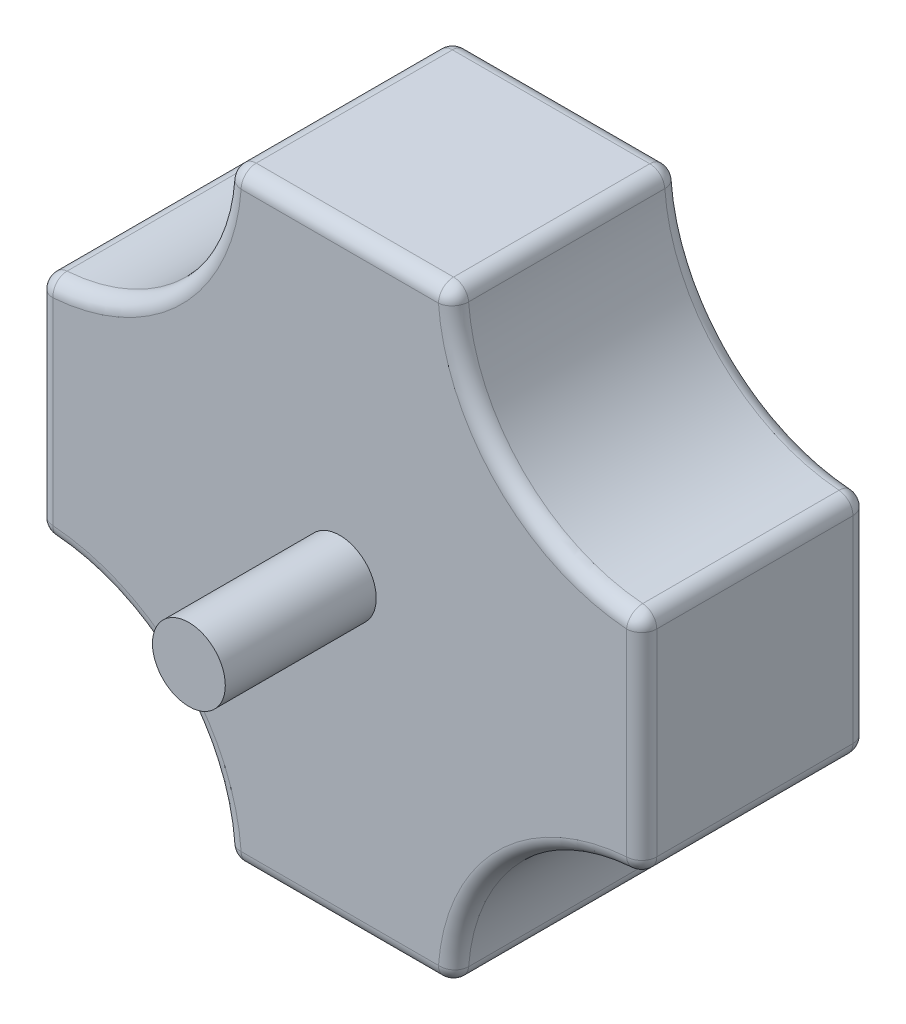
ISO-10303-21;
HEADER;
FILE_DESCRIPTION(('STEP AP214'),'2;1');
FILE_NAME('part.step','',(''),(''),'','','');
FILE_SCHEMA(('AUTOMOTIVE_DESIGN { 1 0 10303 214 1 1 1 1 }'));
ENDSEC;
DATA;
#1=APPLICATION_CONTEXT('core data for automotive mechanical design processes');
#2=APPLICATION_PROTOCOL_DEFINITION('international standard','automotive_design',2000,#1);
#3=PRODUCT_CONTEXT('',#1,'mechanical');
#4=PRODUCT('Part','Part','',(#3));
#5=PRODUCT_RELATED_PRODUCT_CATEGORY('part','',(#4));
#6=PRODUCT_DEFINITION_FORMATION('','',#4);
#7=PRODUCT_DEFINITION_CONTEXT('part definition',#1,'design');
#8=PRODUCT_DEFINITION('design','',#6,#7);
#9=PRODUCT_DEFINITION_SHAPE('','',#8);
#10=(LENGTH_UNIT() NAMED_UNIT(*) SI_UNIT(.MILLI.,.METRE.));
#11=(NAMED_UNIT(*) PLANE_ANGLE_UNIT() SI_UNIT($,.RADIAN.));
#12=(NAMED_UNIT(*) SI_UNIT($,.STERADIAN.) SOLID_ANGLE_UNIT());
#13=UNCERTAINTY_MEASURE_WITH_UNIT(LENGTH_MEASURE(1.E-05),#10,'distance_accuracy_value','');
#14=(GEOMETRIC_REPRESENTATION_CONTEXT(3) GLOBAL_UNCERTAINTY_ASSIGNED_CONTEXT((#13)) GLOBAL_UNIT_ASSIGNED_CONTEXT((#10,
#11,#12)) REPRESENTATION_CONTEXT('',''));
#15=CARTESIAN_POINT('',(0.,0.,0.));
#16=DIRECTION('',(0.,0.,1.));
#17=DIRECTION('',(1.,0.,0.));
#18=AXIS2_PLACEMENT_3D('',#15,#16,#17);
#19=CARTESIAN_POINT('',(20.,20.,15.));
#20=DIRECTION('',(0.,0.,-1.));
#21=DIRECTION('',(-1.,0.,0.));
#22=AXIS2_PLACEMENT_3D('',#19,#20,#21);
#23=PLANE('',#22);
#24=DIRECTION('',(1.,0.,0.));
#25=VECTOR('',#24,1.);
#26=CARTESIAN_POINT('',(20.,-19.,15.));
#27=LINE('',#26,#25);
#28=CARTESIAN_POINT('',(-6.53708798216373,-19.,15.));
#29=VERTEX_POINT('',#28);
#30=CARTESIAN_POINT('',(6.53708798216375,-19.,15.));
#31=VERTEX_POINT('',#30);
#32=EDGE_CURVE('E48',#29,#31,#27,.T.);
#33=ORIENTED_EDGE('',*,*,#32,.T.);
#34=CARTESIAN_POINT('',(20.,-20.,15.));
#35=DIRECTION('',(0.,0.,-1.));
#36=DIRECTION('',(-1.,0.,0.));
#37=AXIS2_PLACEMENT_3D('',#34,#35,#36);
#38=CIRCLE('',#37,13.5);
#39=CARTESIAN_POINT('',(19.,-6.53708798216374,15.));
#40=VERTEX_POINT('',#39);
#41=EDGE_CURVE('E41',#31,#40,#38,.T.);
#42=ORIENTED_EDGE('',*,*,#41,.T.);
#43=DIRECTION('',(0.,1.,0.));
#44=VECTOR('',#43,1.);
#45=CARTESIAN_POINT('',(19.,20.,15.));
#46=LINE('',#45,#44);
#47=CARTESIAN_POINT('',(19.,6.53708798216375,15.));
#48=VERTEX_POINT('',#47);
#49=EDGE_CURVE('E312',#40,#48,#46,.T.);
#50=ORIENTED_EDGE('',*,*,#49,.T.);
#51=CARTESIAN_POINT('',(20.,20.,15.));
#52=DIRECTION('',(0.,0.,-1.));
#53=DIRECTION('',(-1.,0.,0.));
#54=AXIS2_PLACEMENT_3D('',#51,#52,#53);
#55=CIRCLE('',#54,13.5);
#56=CARTESIAN_POINT('',(6.53708798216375,19.,15.));
#57=VERTEX_POINT('',#56);
#58=EDGE_CURVE('E314',#48,#57,#55,.T.);
#59=ORIENTED_EDGE('',*,*,#58,.T.);
#60=DIRECTION('',(-1.,0.,0.));
#61=VECTOR('',#60,1.);
#62=CARTESIAN_POINT('',(20.,19.,15.));
#63=LINE('',#62,#61);
#64=CARTESIAN_POINT('',(-6.53708798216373,19.,15.));
#65=VERTEX_POINT('',#64);
#66=EDGE_CURVE('E316',#57,#65,#63,.T.);
#67=ORIENTED_EDGE('',*,*,#66,.T.);
#68=CARTESIAN_POINT('',(-20.,20.,15.));
#69=DIRECTION('',(0.,0.,-1.));
#70=DIRECTION('',(-1.,0.,0.));
#71=AXIS2_PLACEMENT_3D('',#68,#69,#70);
#72=CIRCLE('',#71,13.5);
#73=CARTESIAN_POINT('',(-19.,6.53708798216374,15.));
#74=VERTEX_POINT('',#73);
#75=EDGE_CURVE('E318',#65,#74,#72,.T.);
#76=ORIENTED_EDGE('',*,*,#75,.T.);
#77=DIRECTION('',(0.,-1.,0.));
#78=VECTOR('',#77,1.);
#79=CARTESIAN_POINT('',(-19.,20.,15.));
#80=LINE('',#79,#78);
#81=CARTESIAN_POINT('',(-19.,-6.53708798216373,15.));
#82=VERTEX_POINT('',#81);
#83=EDGE_CURVE('E320',#74,#82,#80,.T.);
#84=ORIENTED_EDGE('',*,*,#83,.T.);
#85=CARTESIAN_POINT('',(-20.,-20.,15.));
#86=DIRECTION('',(0.,0.,-1.));
#87=DIRECTION('',(-1.,0.,0.));
#88=AXIS2_PLACEMENT_3D('',#85,#86,#87);
#89=CIRCLE('',#88,13.5);
#90=EDGE_CURVE('E53',#82,#29,#89,.T.);
#91=ORIENTED_EDGE('',*,*,#90,.T.);
#92=EDGE_LOOP('',(#33,#42,#50,#59,#67,#76,#84,#91));
#93=FACE_BOUND('',#92,.T.);
#94=CARTESIAN_POINT('',(0.,0.,15.));
#95=DIRECTION('',(0.,0.,-1.));
#96=DIRECTION('',(-1.,0.,0.));
#97=AXIS2_PLACEMENT_3D('',#94,#95,#96);
#98=CIRCLE('',#97,2.413);
#99=CARTESIAN_POINT('',(-2.413,0.,15.));
#100=VERTEX_POINT('',#99);
#101=EDGE_CURVE('E11',#100,#100,#98,.F.);
#102=ORIENTED_EDGE('',*,*,#101,.F.);
#103=EDGE_LOOP('',(#102));
#104=FACE_BOUND('',#103,.T.);
#105=ADVANCED_FACE('F33',(#93,#104),#23,.F.);
#106=CARTESIAN_POINT('',(20.,-20.,15.));
#107=DIRECTION('',(-1.,0.,0.));
#108=DIRECTION('',(0.,0.,1.));
#109=AXIS2_PLACEMENT_3D('',#106,#107,#108);
#110=PLANE('',#109);
#111=DIRECTION('',(0.,0.,1.));
#112=VECTOR('',#111,1.);
#113=CARTESIAN_POINT('',(20.,-6.53708798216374,15.));
#114=LINE('',#113,#112);
#115=CARTESIAN_POINT('',(20.,-6.53708798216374,14.));
#116=VERTEX_POINT('',#115);
#117=CARTESIAN_POINT('',(20.,-6.53708798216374,1.));
#118=VERTEX_POINT('',#117);
#119=EDGE_CURVE('E272',#116,#118,#114,.F.);
#120=ORIENTED_EDGE('',*,*,#119,.T.);
#121=DIRECTION('',(0.,1.,0.));
#122=VECTOR('',#121,1.);
#123=CARTESIAN_POINT('',(20.,7.50000000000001,1.));
#124=LINE('',#123,#122);
#125=CARTESIAN_POINT('',(20.,6.53708798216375,1.));
#126=VERTEX_POINT('',#125);
#127=EDGE_CURVE('E275',#118,#126,#124,.T.);
#128=ORIENTED_EDGE('',*,*,#127,.T.);
#129=DIRECTION('',(0.,0.,1.));
#130=VECTOR('',#129,1.);
#131=CARTESIAN_POINT('',(20.,6.53708798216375,15.));
#132=LINE('',#131,#130);
#133=CARTESIAN_POINT('',(20.,6.53708798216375,14.));
#134=VERTEX_POINT('',#133);
#135=EDGE_CURVE('E270',#126,#134,#132,.T.);
#136=ORIENTED_EDGE('',*,*,#135,.T.);
#137=DIRECTION('',(0.,1.,0.));
#138=VECTOR('',#137,1.);
#139=CARTESIAN_POINT('',(20.,-20.,14.));
#140=LINE('',#139,#138);
#141=EDGE_CURVE('E268',#134,#116,#140,.F.);
#142=ORIENTED_EDGE('',*,*,#141,.T.);
#143=EDGE_LOOP('',(#120,#128,#136,#142));
#144=FACE_BOUND('',#143,.T.);
#145=ADVANCED_FACE('F541',(#144),#110,.F.);
#146=CARTESIAN_POINT('',(-20.,20.,15.));
#147=DIRECTION('',(0.,-1.,0.));
#148=DIRECTION('',(0.,0.,-1.));
#149=AXIS2_PLACEMENT_3D('',#146,#147,#148);
#150=PLANE('',#149);
#151=DIRECTION('',(0.,0.,1.));
#152=VECTOR('',#151,1.);
#153=CARTESIAN_POINT('',(6.53708798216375,20.,15.));
#154=LINE('',#153,#152);
#155=CARTESIAN_POINT('',(6.53708798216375,20.,14.));
#156=VERTEX_POINT('',#155);
#157=CARTESIAN_POINT('',(6.53708798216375,20.,1.));
#158=VERTEX_POINT('',#157);
#159=EDGE_CURVE('E223',#156,#158,#154,.F.);
#160=ORIENTED_EDGE('',*,*,#159,.T.);
#161=DIRECTION('',(-1.,0.,0.));
#162=VECTOR('',#161,1.);
#163=CARTESIAN_POINT('',(-7.5,20.,1.));
#164=LINE('',#163,#162);
#165=CARTESIAN_POINT('',(-6.53708798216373,20.,1.));
#166=VERTEX_POINT('',#165);
#167=EDGE_CURVE('E228',#158,#166,#164,.T.);
#168=ORIENTED_EDGE('',*,*,#167,.T.);
#169=DIRECTION('',(0.,0.,1.));
#170=VECTOR('',#169,1.);
#171=CARTESIAN_POINT('',(-6.53708798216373,20.,15.));
#172=LINE('',#171,#170);
#173=CARTESIAN_POINT('',(-6.53708798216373,20.,14.));
#174=VERTEX_POINT('',#173);
#175=EDGE_CURVE('E198',#166,#174,#172,.T.);
#176=ORIENTED_EDGE('',*,*,#175,.T.);
#177=DIRECTION('',(-1.,0.,0.));
#178=VECTOR('',#177,1.);
#179=CARTESIAN_POINT('',(-20.,20.,14.));
#180=LINE('',#179,#178);
#181=EDGE_CURVE('E217',#174,#156,#180,.F.);
#182=ORIENTED_EDGE('',*,*,#181,.T.);
#183=EDGE_LOOP('',(#160,#168,#176,#182));
#184=FACE_BOUND('',#183,.T.);
#185=ADVANCED_FACE('F226',(#184),#150,.F.);
#186=CARTESIAN_POINT('',(-20.,-20.,15.));
#187=DIRECTION('',(1.,0.,0.));
#188=DIRECTION('',(0.,0.,-1.));
#189=AXIS2_PLACEMENT_3D('',#186,#187,#188);
#190=PLANE('',#189);
#191=DIRECTION('',(0.,0.,1.));
#192=VECTOR('',#191,1.);
#193=CARTESIAN_POINT('',(-20.,6.53708798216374,15.));
#194=LINE('',#193,#192);
#195=CARTESIAN_POINT('',(-20.,6.53708798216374,14.));
#196=VERTEX_POINT('',#195);
#197=CARTESIAN_POINT('',(-20.,6.53708798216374,1.));
#198=VERTEX_POINT('',#197);
#199=EDGE_CURVE('E254',#196,#198,#194,.F.);
#200=ORIENTED_EDGE('',*,*,#199,.T.);
#201=DIRECTION('',(0.,-1.,0.));
#202=VECTOR('',#201,1.);
#203=CARTESIAN_POINT('',(-20.,-7.5,1.));
#204=LINE('',#203,#202);
#205=CARTESIAN_POINT('',(-20.,-6.53708798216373,1.));
#206=VERTEX_POINT('',#205);
#207=EDGE_CURVE('E257',#198,#206,#204,.T.);
#208=ORIENTED_EDGE('',*,*,#207,.T.);
#209=DIRECTION('',(0.,0.,1.));
#210=VECTOR('',#209,1.);
#211=CARTESIAN_POINT('',(-20.,-6.53708798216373,15.));
#212=LINE('',#211,#210);
#213=CARTESIAN_POINT('',(-20.,-6.53708798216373,14.));
#214=VERTEX_POINT('',#213);
#215=EDGE_CURVE('E252',#206,#214,#212,.T.);
#216=ORIENTED_EDGE('',*,*,#215,.T.);
#217=DIRECTION('',(0.,-1.,0.));
#218=VECTOR('',#217,1.);
#219=CARTESIAN_POINT('',(-20.,-20.,14.));
#220=LINE('',#219,#218);
#221=EDGE_CURVE('E250',#214,#196,#220,.F.);
#222=ORIENTED_EDGE('',*,*,#221,.T.);
#223=EDGE_LOOP('',(#200,#208,#216,#222));
#224=FACE_BOUND('',#223,.T.);
#225=ADVANCED_FACE('F559',(#224),#190,.F.);
#226=CARTESIAN_POINT('',(-20.,-20.,15.));
#227=DIRECTION('',(0.,1.,0.));
#228=DIRECTION('',(0.,0.,1.));
#229=AXIS2_PLACEMENT_3D('',#226,#227,#228);
#230=PLANE('',#229);
#231=DIRECTION('',(0.,0.,1.));
#232=VECTOR('',#231,1.);
#233=CARTESIAN_POINT('',(-6.53708798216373,-20.,15.));
#234=LINE('',#233,#232);
#235=CARTESIAN_POINT('',(-6.53708798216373,-20.,14.));
#236=VERTEX_POINT('',#235);
#237=CARTESIAN_POINT('',(-6.53708798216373,-20.,1.));
#238=VERTEX_POINT('',#237);
#239=EDGE_CURVE('E290',#236,#238,#234,.F.);
#240=ORIENTED_EDGE('',*,*,#239,.T.);
#241=DIRECTION('',(1.,0.,0.));
#242=VECTOR('',#241,1.);
#243=CARTESIAN_POINT('',(7.50000000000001,-20.,1.));
#244=LINE('',#243,#242);
#245=CARTESIAN_POINT('',(6.53708798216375,-20.,1.));
#246=VERTEX_POINT('',#245);
#247=EDGE_CURVE('E293',#238,#246,#244,.T.);
#248=ORIENTED_EDGE('',*,*,#247,.T.);
#249=DIRECTION('',(0.,0.,1.));
#250=VECTOR('',#249,1.);
#251=CARTESIAN_POINT('',(6.53708798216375,-20.,15.));
#252=LINE('',#251,#250);
#253=CARTESIAN_POINT('',(6.53708798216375,-20.,14.));
#254=VERTEX_POINT('',#253);
#255=EDGE_CURVE('E288',#246,#254,#252,.T.);
#256=ORIENTED_EDGE('',*,*,#255,.T.);
#257=DIRECTION('',(1.,0.,0.));
#258=VECTOR('',#257,1.);
#259=CARTESIAN_POINT('',(-20.,-20.,14.));
#260=LINE('',#259,#258);
#261=EDGE_CURVE('E286',#254,#236,#260,.F.);
#262=ORIENTED_EDGE('',*,*,#261,.T.);
#263=EDGE_LOOP('',(#240,#248,#256,#262));
#264=FACE_BOUND('',#263,.T.);
#265=ADVANCED_FACE('F496',(#264),#230,.F.);
#266=CARTESIAN_POINT('',(20.,20.,0.));
#267=DIRECTION('',(0.,0.,-1.));
#268=DIRECTION('',(-1.,0.,0.));
#269=AXIS2_PLACEMENT_3D('',#266,#267,#268);
#270=PLANE('',#269);
#271=CARTESIAN_POINT('',(-20.,20.,0.));
#272=DIRECTION('',(0.,0.,-1.));
#273=DIRECTION('',(-1.,0.,0.));
#274=AXIS2_PLACEMENT_3D('',#271,#272,#273);
#275=CIRCLE('',#274,13.5);
#276=CARTESIAN_POINT('',(-19.,6.53708798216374,0.));
#277=VERTEX_POINT('',#276);
#278=CARTESIAN_POINT('',(-6.53708798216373,19.,0.));
#279=VERTEX_POINT('',#278);
#280=EDGE_CURVE('E307',#277,#279,#275,.F.);
#281=ORIENTED_EDGE('',*,*,#280,.T.);
#282=DIRECTION('',(-1.,0.,0.));
#283=VECTOR('',#282,1.);
#284=CARTESIAN_POINT('',(7.50000000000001,19.,0.));
#285=LINE('',#284,#283);
#286=CARTESIAN_POINT('',(6.53708798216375,19.,0.));
#287=VERTEX_POINT('',#286);
#288=EDGE_CURVE('E309',#279,#287,#285,.F.);
#289=ORIENTED_EDGE('',*,*,#288,.T.);
#290=CARTESIAN_POINT('',(20.,20.,0.));
#291=DIRECTION('',(0.,0.,-1.));
#292=DIRECTION('',(-1.,0.,0.));
#293=AXIS2_PLACEMENT_3D('',#290,#291,#292);
#294=CIRCLE('',#293,13.5);
#295=CARTESIAN_POINT('',(19.,6.53708798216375,0.));
#296=VERTEX_POINT('',#295);
#297=EDGE_CURVE('E295',#287,#296,#294,.F.);
#298=ORIENTED_EDGE('',*,*,#297,.T.);
#299=DIRECTION('',(0.,1.,0.));
#300=VECTOR('',#299,1.);
#301=CARTESIAN_POINT('',(19.,-7.5,0.));
#302=LINE('',#301,#300);
#303=CARTESIAN_POINT('',(19.,-6.53708798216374,0.));
#304=VERTEX_POINT('',#303);
#305=EDGE_CURVE('E297',#296,#304,#302,.F.);
#306=ORIENTED_EDGE('',*,*,#305,.T.);
#307=CARTESIAN_POINT('',(20.,-20.,0.));
#308=DIRECTION('',(0.,0.,-1.));
#309=DIRECTION('',(-1.,0.,0.));
#310=AXIS2_PLACEMENT_3D('',#307,#308,#309);
#311=CIRCLE('',#310,13.5);
#312=CARTESIAN_POINT('',(6.53708798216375,-19.,0.));
#313=VERTEX_POINT('',#312);
#314=EDGE_CURVE('E299',#304,#313,#311,.F.);
#315=ORIENTED_EDGE('',*,*,#314,.T.);
#316=DIRECTION('',(1.,0.,0.));
#317=VECTOR('',#316,1.);
#318=CARTESIAN_POINT('',(-7.5,-19.,0.));
#319=LINE('',#318,#317);
#320=CARTESIAN_POINT('',(-6.53708798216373,-19.,0.));
#321=VERTEX_POINT('',#320);
#322=EDGE_CURVE('E301',#313,#321,#319,.F.);
#323=ORIENTED_EDGE('',*,*,#322,.T.);
#324=CARTESIAN_POINT('',(-20.,-20.,0.));
#325=DIRECTION('',(0.,0.,-1.));
#326=DIRECTION('',(-1.,0.,0.));
#327=AXIS2_PLACEMENT_3D('',#324,#325,#326);
#328=CIRCLE('',#327,13.5);
#329=CARTESIAN_POINT('',(-19.,-6.53708798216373,0.));
#330=VERTEX_POINT('',#329);
#331=EDGE_CURVE('E303',#321,#330,#328,.F.);
#332=ORIENTED_EDGE('',*,*,#331,.T.);
#333=DIRECTION('',(0.,-1.,0.));
#334=VECTOR('',#333,1.);
#335=CARTESIAN_POINT('',(-19.,7.5,0.));
#336=LINE('',#335,#334);
#337=EDGE_CURVE('E305',#330,#277,#336,.F.);
#338=ORIENTED_EDGE('',*,*,#337,.T.);
#339=EDGE_LOOP('',(#281,#289,#298,#306,#315,#323,#332,#338));
#340=FACE_BOUND('',#339,.T.);
#341=ADVANCED_FACE('F462',(#340),#270,.T.);
#342=CARTESIAN_POINT('',(-20.,20.,0.));
#343=DIRECTION('',(0.,0.,1.));
#344=DIRECTION('',(1.,0.,0.));
#345=AXIS2_PLACEMENT_3D('',#342,#343,#344);
#346=CYLINDRICAL_SURFACE('',#345,12.5);
#347=DIRECTION('',(0.,0.,1.));
#348=VECTOR('',#347,1.);
#349=CARTESIAN_POINT('',(-7.53434072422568,19.0740740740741,0.));
#350=LINE('',#349,#348);
#351=CARTESIAN_POINT('',(-7.53434072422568,19.0740740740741,14.));
#352=VERTEX_POINT('',#351);
#353=CARTESIAN_POINT('',(-7.53434072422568,19.0740740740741,1.));
#354=VERTEX_POINT('',#353);
#355=EDGE_CURVE('E200',#352,#354,#350,.F.);
#356=ORIENTED_EDGE('',*,*,#355,.T.);
#357=CARTESIAN_POINT('',(-20.,20.,1.));
#358=DIRECTION('',(0.,0.,-1.));
#359=DIRECTION('',(-1.,0.,0.));
#360=AXIS2_PLACEMENT_3D('',#357,#358,#359);
#361=CIRCLE('',#360,12.5);
#362=CARTESIAN_POINT('',(-19.0740740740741,7.53434072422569,1.));
#363=VERTEX_POINT('',#362);
#364=EDGE_CURVE('E239',#354,#363,#361,.T.);
#365=ORIENTED_EDGE('',*,*,#364,.T.);
#366=DIRECTION('',(0.,0.,1.));
#367=VECTOR('',#366,1.);
#368=CARTESIAN_POINT('',(-19.0740740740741,7.53434072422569,0.));
#369=LINE('',#368,#367);
#370=CARTESIAN_POINT('',(-19.0740740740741,7.53434072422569,14.));
#371=VERTEX_POINT('',#370);
#372=EDGE_CURVE('E236',#363,#371,#369,.T.);
#373=ORIENTED_EDGE('',*,*,#372,.T.);
#374=CARTESIAN_POINT('',(-20.,20.,14.));
#375=DIRECTION('',(0.,0.,-1.));
#376=DIRECTION('',(-1.,0.,0.));
#377=AXIS2_PLACEMENT_3D('',#374,#375,#376);
#378=CIRCLE('',#377,12.5);
#379=EDGE_CURVE('E231',#371,#352,#378,.F.);
#380=ORIENTED_EDGE('',*,*,#379,.T.);
#381=EDGE_LOOP('',(#356,#365,#373,#380));
#382=FACE_BOUND('',#381,.T.);
#383=ADVANCED_FACE('F553',(#382),#346,.F.);
#384=CARTESIAN_POINT('',(-20.,-20.,0.));
#385=DIRECTION('',(0.,0.,1.));
#386=DIRECTION('',(1.,0.,0.));
#387=AXIS2_PLACEMENT_3D('',#384,#385,#386);
#388=CYLINDRICAL_SURFACE('',#387,12.5);
#389=DIRECTION('',(0.,0.,1.));
#390=VECTOR('',#389,1.);
#391=CARTESIAN_POINT('',(-19.0740740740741,-7.53434072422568,0.));
#392=LINE('',#391,#390);
#393=CARTESIAN_POINT('',(-19.0740740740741,-7.53434072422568,14.));
#394=VERTEX_POINT('',#393);
#395=CARTESIAN_POINT('',(-19.0740740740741,-7.53434072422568,1.));
#396=VERTEX_POINT('',#395);
#397=EDGE_CURVE('E263',#394,#396,#392,.F.);
#398=ORIENTED_EDGE('',*,*,#397,.T.);
#399=CARTESIAN_POINT('',(-20.,-20.,1.));
#400=DIRECTION('',(0.,0.,-1.));
#401=DIRECTION('',(-1.,0.,0.));
#402=AXIS2_PLACEMENT_3D('',#399,#400,#401);
#403=CIRCLE('',#402,12.5);
#404=CARTESIAN_POINT('',(-7.53434072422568,-19.0740740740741,1.));
#405=VERTEX_POINT('',#404);
#406=EDGE_CURVE('E266',#396,#405,#403,.T.);
#407=ORIENTED_EDGE('',*,*,#406,.T.);
#408=DIRECTION('',(0.,0.,1.));
#409=VECTOR('',#408,1.);
#410=CARTESIAN_POINT('',(-7.53434072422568,-19.0740740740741,0.));
#411=LINE('',#410,#409);
#412=CARTESIAN_POINT('',(-7.53434072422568,-19.0740740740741,14.));
#413=VERTEX_POINT('',#412);
#414=EDGE_CURVE('E261',#405,#413,#411,.T.);
#415=ORIENTED_EDGE('',*,*,#414,.T.);
#416=CARTESIAN_POINT('',(-20.,-20.,14.));
#417=DIRECTION('',(0.,0.,-1.));
#418=DIRECTION('',(-1.,0.,0.));
#419=AXIS2_PLACEMENT_3D('',#416,#417,#418);
#420=CIRCLE('',#419,12.5);
#421=EDGE_CURVE('E259',#413,#394,#420,.F.);
#422=ORIENTED_EDGE('',*,*,#421,.T.);
#423=EDGE_LOOP('',(#398,#407,#415,#422));
#424=FACE_BOUND('',#423,.T.);
#425=ADVANCED_FACE('F585',(#424),#388,.F.);
#426=CARTESIAN_POINT('',(20.,-20.,0.));
#427=DIRECTION('',(0.,0.,1.));
#428=DIRECTION('',(1.,0.,0.));
#429=AXIS2_PLACEMENT_3D('',#426,#427,#428);
#430=CYLINDRICAL_SURFACE('',#429,12.5);
#431=DIRECTION('',(0.,0.,1.));
#432=VECTOR('',#431,1.);
#433=CARTESIAN_POINT('',(7.53434072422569,-19.0740740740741,0.));
#434=LINE('',#433,#432);
#435=CARTESIAN_POINT('',(7.53434072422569,-19.0740740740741,14.));
#436=VERTEX_POINT('',#435);
#437=CARTESIAN_POINT('',(7.53434072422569,-19.0740740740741,1.));
#438=VERTEX_POINT('',#437);
#439=EDGE_CURVE('E279',#436,#438,#434,.F.);
#440=ORIENTED_EDGE('',*,*,#439,.T.);
#441=CARTESIAN_POINT('',(20.,-20.,1.));
#442=DIRECTION('',(0.,0.,-1.));
#443=DIRECTION('',(-1.,0.,0.));
#444=AXIS2_PLACEMENT_3D('',#441,#442,#443);
#445=CIRCLE('',#444,12.5);
#446=CARTESIAN_POINT('',(19.0740740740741,-7.53434072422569,1.));
#447=VERTEX_POINT('',#446);
#448=EDGE_CURVE('E284',#438,#447,#445,.T.);
#449=ORIENTED_EDGE('',*,*,#448,.T.);
#450=DIRECTION('',(0.,0.,1.));
#451=VECTOR('',#450,1.);
#452=CARTESIAN_POINT('',(19.0740740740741,-7.53434072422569,0.));
#453=LINE('',#452,#451);
#454=CARTESIAN_POINT('',(19.0740740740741,-7.53434072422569,14.));
#455=VERTEX_POINT('',#454);
#456=EDGE_CURVE('E281',#447,#455,#453,.T.);
#457=ORIENTED_EDGE('',*,*,#456,.T.);
#458=CARTESIAN_POINT('',(20.,-20.,14.));
#459=DIRECTION('',(0.,0.,-1.));
#460=DIRECTION('',(-1.,0.,0.));
#461=AXIS2_PLACEMENT_3D('',#458,#459,#460);
#462=CIRCLE('',#461,12.5);
#463=EDGE_CURVE('E277',#455,#436,#462,.F.);
#464=ORIENTED_EDGE('',*,*,#463,.T.);
#465=EDGE_LOOP('',(#440,#449,#457,#464));
#466=FACE_BOUND('',#465,.T.);
#467=ADVANCED_FACE('F472',(#466),#430,.F.);
#468=CARTESIAN_POINT('',(20.,20.,0.));
#469=DIRECTION('',(0.,0.,1.));
#470=DIRECTION('',(1.,0.,0.));
#471=AXIS2_PLACEMENT_3D('',#468,#469,#470);
#472=CYLINDRICAL_SURFACE('',#471,12.5);
#473=DIRECTION('',(0.,0.,1.));
#474=VECTOR('',#473,1.);
#475=CARTESIAN_POINT('',(19.0740740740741,7.53434072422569,0.));
#476=LINE('',#475,#474);
#477=CARTESIAN_POINT('',(19.0740740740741,7.53434072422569,14.));
#478=VERTEX_POINT('',#477);
#479=CARTESIAN_POINT('',(19.0740740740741,7.53434072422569,1.));
#480=VERTEX_POINT('',#479);
#481=EDGE_CURVE('E243',#478,#480,#476,.F.);
#482=ORIENTED_EDGE('',*,*,#481,.T.);
#483=CARTESIAN_POINT('',(20.,20.,1.));
#484=DIRECTION('',(0.,0.,-1.));
#485=DIRECTION('',(-1.,0.,0.));
#486=AXIS2_PLACEMENT_3D('',#483,#484,#485);
#487=CIRCLE('',#486,12.5);
#488=CARTESIAN_POINT('',(7.53434072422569,19.0740740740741,1.));
#489=VERTEX_POINT('',#488);
#490=EDGE_CURVE('E248',#480,#489,#487,.T.);
#491=ORIENTED_EDGE('',*,*,#490,.T.);
#492=DIRECTION('',(0.,0.,1.));
#493=VECTOR('',#492,1.);
#494=CARTESIAN_POINT('',(7.53434072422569,19.0740740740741,0.));
#495=LINE('',#494,#493);
#496=CARTESIAN_POINT('',(7.53434072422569,19.0740740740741,14.));
#497=VERTEX_POINT('',#496);
#498=EDGE_CURVE('E245',#489,#497,#495,.T.);
#499=ORIENTED_EDGE('',*,*,#498,.T.);
#500=CARTESIAN_POINT('',(20.,20.,14.));
#501=DIRECTION('',(0.,0.,-1.));
#502=DIRECTION('',(-1.,0.,0.));
#503=AXIS2_PLACEMENT_3D('',#500,#501,#502);
#504=CIRCLE('',#503,12.5);
#505=EDGE_CURVE('E241',#497,#478,#504,.F.);
#506=ORIENTED_EDGE('',*,*,#505,.T.);
#507=EDGE_LOOP('',(#482,#491,#499,#506));
#508=FACE_BOUND('',#507,.T.);
#509=ADVANCED_FACE('F580',(#508),#472,.F.);
#510=CARTESIAN_POINT('',(6.53708798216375,-19.,0.));
#511=DIRECTION('',(0.,0.,1.));
#512=DIRECTION('',(1.,0.,0.));
#513=AXIS2_PLACEMENT_3D('',#510,#511,#512);
#514=CYLINDRICAL_SURFACE('',#513,1.);
#515=CARTESIAN_POINT('',(6.53708798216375,-19.,1.));
#516=DIRECTION('',(0.,0.,-1.));
#517=DIRECTION('',(0.,1.,0.));
#518=AXIS2_PLACEMENT_3D('',#515,#516,#517);
#519=CIRCLE('',#518,1.);
#520=EDGE_CURVE('E224',#438,#246,#519,.T.);
#521=ORIENTED_EDGE('',*,*,#520,.F.);
#522=ORIENTED_EDGE('',*,*,#439,.F.);
#523=CARTESIAN_POINT('',(6.53708798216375,-19.,14.));
#524=DIRECTION('',(0.,0.,1.));
#525=DIRECTION('',(1.,0.,0.));
#526=AXIS2_PLACEMENT_3D('',#523,#524,#525);
#527=CIRCLE('',#526,1.);
#528=EDGE_CURVE('E443',#254,#436,#527,.T.);
#529=ORIENTED_EDGE('',*,*,#528,.F.);
#530=ORIENTED_EDGE('',*,*,#255,.F.);
#531=EDGE_LOOP('',(#521,#522,#529,#530));
#532=FACE_BOUND('',#531,.T.);
#533=ADVANCED_FACE('F35',(#532),#514,.T.);
#534=CARTESIAN_POINT('',(6.53708798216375,-19.,1.));
#535=DIRECTION('',(0.,0.,1.));
#536=DIRECTION('',(1.,0.,0.));
#537=AXIS2_PLACEMENT_3D('',#534,#535,#536);
#538=SPHERICAL_SURFACE('',#537,1.);
#539=CARTESIAN_POINT('',(6.53708798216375,-19.,1.));
#540=DIRECTION('',(-0.0740740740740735,-0.997252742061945,0.));
#541=DIRECTION('',(0.997252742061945,-0.0740740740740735,0.));
#542=AXIS2_PLACEMENT_3D('',#539,#540,#541);
#543=CIRCLE('',#542,1.);
#544=EDGE_CURVE('E437',#438,#313,#543,.F.);
#545=ORIENTED_EDGE('',*,*,#544,.F.);
#546=ORIENTED_EDGE('',*,*,#520,.T.);
#547=CARTESIAN_POINT('',(6.53708798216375,-19.,1.));
#548=DIRECTION('',(1.,0.,0.));
#549=DIRECTION('',(0.,0.,-1.));
#550=AXIS2_PLACEMENT_3D('',#547,#548,#549);
#551=CIRCLE('',#550,1.);
#552=EDGE_CURVE('E440',#313,#246,#551,.F.);
#553=ORIENTED_EDGE('',*,*,#552,.F.);
#554=EDGE_LOOP('',(#545,#546,#553));
#555=FACE_BOUND('',#554,.T.);
#556=ADVANCED_FACE('F450',(#555),#538,.T.);
#557=CARTESIAN_POINT('',(6.53708798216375,-19.,14.));
#558=DIRECTION('',(0.,0.,1.));
#559=DIRECTION('',(1.,0.,0.));
#560=AXIS2_PLACEMENT_3D('',#557,#558,#559);
#561=SPHERICAL_SURFACE('',#560,1.);
#562=CARTESIAN_POINT('',(6.53708798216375,-19.,14.));
#563=DIRECTION('',(1.,0.,0.));
#564=DIRECTION('',(0.,1.,0.));
#565=AXIS2_PLACEMENT_3D('',#562,#563,#564);
#566=CIRCLE('',#565,1.);
#567=EDGE_CURVE('E432',#254,#31,#566,.F.);
#568=ORIENTED_EDGE('',*,*,#567,.F.);
#569=ORIENTED_EDGE('',*,*,#528,.T.);
#570=CARTESIAN_POINT('',(6.53708798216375,-19.,14.));
#571=DIRECTION('',(-0.0740740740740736,-0.997252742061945,0.));
#572=DIRECTION('',(0.997252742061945,-0.0740740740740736,0.));
#573=AXIS2_PLACEMENT_3D('',#570,#571,#572);
#574=CIRCLE('',#573,1.);
#575=EDGE_CURVE('E434',#31,#436,#574,.F.);
#576=ORIENTED_EDGE('',*,*,#575,.F.);
#577=EDGE_LOOP('',(#568,#569,#576));
#578=FACE_BOUND('',#577,.T.);
#579=ADVANCED_FACE('F489',(#578),#561,.T.);
#580=CARTESIAN_POINT('',(-20.,-19.,1.));
#581=DIRECTION('',(-1.,0.,0.));
#582=DIRECTION('',(0.,0.,1.));
#583=AXIS2_PLACEMENT_3D('',#580,#581,#582);
#584=CYLINDRICAL_SURFACE('',#583,1.);
#585=ORIENTED_EDGE('',*,*,#552,.T.);
#586=ORIENTED_EDGE('',*,*,#247,.F.);
#587=CARTESIAN_POINT('',(-6.53708798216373,-19.,1.));
#588=DIRECTION('',(-1.,0.,0.));
#589=DIRECTION('',(0.,0.,1.));
#590=AXIS2_PLACEMENT_3D('',#587,#588,#589);
#591=CIRCLE('',#590,1.);
#592=EDGE_CURVE('E427',#321,#238,#591,.T.);
#593=ORIENTED_EDGE('',*,*,#592,.F.);
#594=ORIENTED_EDGE('',*,*,#322,.F.);
#595=EDGE_LOOP('',(#585,#586,#593,#594));
#596=FACE_BOUND('',#595,.T.);
#597=ADVANCED_FACE('F458',(#596),#584,.T.);
#598=CARTESIAN_POINT('',(20.,-20.,1.));
#599=DIRECTION('',(0.,0.,-1.));
#600=DIRECTION('',(-1.,0.,0.));
#601=AXIS2_PLACEMENT_3D('',#598,#599,#600);
#602=TOROIDAL_SURFACE('',#601,13.5,1.);
#603=ORIENTED_EDGE('',*,*,#544,.T.);
#604=ORIENTED_EDGE('',*,*,#314,.F.);
#605=CARTESIAN_POINT('',(19.,-6.53708798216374,1.));
#606=DIRECTION('',(0.997252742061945,0.0740740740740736,0.));
#607=DIRECTION('',(-0.0740740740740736,0.997252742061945,0.));
#608=AXIS2_PLACEMENT_3D('',#605,#606,#607);
#609=CIRCLE('',#608,1.);
#610=EDGE_CURVE('E424',#447,#304,#609,.T.);
#611=ORIENTED_EDGE('',*,*,#610,.F.);
#612=ORIENTED_EDGE('',*,*,#448,.F.);
#613=EDGE_LOOP('',(#603,#604,#611,#612));
#614=FACE_BOUND('',#613,.T.);
#615=ADVANCED_FACE('F469',(#614),#602,.T.);
#616=CARTESIAN_POINT('',(19.,-6.53708798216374,0.));
#617=DIRECTION('',(0.,0.,1.));
#618=DIRECTION('',(1.,0.,0.));
#619=AXIS2_PLACEMENT_3D('',#616,#617,#618);
#620=CYLINDRICAL_SURFACE('',#619,1.);
#621=CARTESIAN_POINT('',(19.,-6.53708798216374,14.));
#622=DIRECTION('',(0.,0.,1.));
#623=DIRECTION('',(1.,0.,0.));
#624=AXIS2_PLACEMENT_3D('',#621,#622,#623);
#625=CIRCLE('',#624,1.);
#626=EDGE_CURVE('E418',#455,#116,#625,.T.);
#627=ORIENTED_EDGE('',*,*,#626,.F.);
#628=ORIENTED_EDGE('',*,*,#456,.F.);
#629=CARTESIAN_POINT('',(19.,-6.53708798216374,1.));
#630=DIRECTION('',(0.,0.,-1.));
#631=DIRECTION('',(0.,1.,0.));
#632=AXIS2_PLACEMENT_3D('',#629,#630,#631);
#633=CIRCLE('',#632,1.);
#634=EDGE_CURVE('E421',#118,#447,#633,.T.);
#635=ORIENTED_EDGE('',*,*,#634,.F.);
#636=ORIENTED_EDGE('',*,*,#119,.F.);
#637=EDGE_LOOP('',(#627,#628,#635,#636));
#638=FACE_BOUND('',#637,.T.);
#639=ADVANCED_FACE('F476',(#638),#620,.T.);
#640=CARTESIAN_POINT('',(20.,-20.,14.));
#641=DIRECTION('',(0.,0.,-1.));
#642=DIRECTION('',(-1.,0.,0.));
#643=AXIS2_PLACEMENT_3D('',#640,#641,#642);
#644=TOROIDAL_SURFACE('',#643,13.5,1.);
#645=ORIENTED_EDGE('',*,*,#575,.T.);
#646=ORIENTED_EDGE('',*,*,#463,.F.);
#647=CARTESIAN_POINT('',(19.,-6.53708798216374,14.));
#648=DIRECTION('',(0.997252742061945,0.0740740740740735,0.));
#649=DIRECTION('',(-0.0740740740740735,0.997252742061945,0.));
#650=AXIS2_PLACEMENT_3D('',#647,#648,#649);
#651=CIRCLE('',#650,1.);
#652=EDGE_CURVE('E416',#40,#455,#651,.T.);
#653=ORIENTED_EDGE('',*,*,#652,.F.);
#654=ORIENTED_EDGE('',*,*,#41,.F.);
#655=EDGE_LOOP('',(#645,#646,#653,#654));
#656=FACE_BOUND('',#655,.T.);
#657=ADVANCED_FACE('F483',(#656),#644,.T.);
#658=CARTESIAN_POINT('',(20.,-19.,14.));
#659=DIRECTION('',(1.,0.,0.));
#660=DIRECTION('',(0.,0.,-1.));
#661=AXIS2_PLACEMENT_3D('',#658,#659,#660);
#662=CYLINDRICAL_SURFACE('',#661,1.);
#663=ORIENTED_EDGE('',*,*,#567,.T.);
#664=ORIENTED_EDGE('',*,*,#32,.F.);
#665=CARTESIAN_POINT('',(-6.53708798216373,-19.,14.));
#666=DIRECTION('',(-1.,0.,0.));
#667=DIRECTION('',(0.,0.,1.));
#668=AXIS2_PLACEMENT_3D('',#665,#666,#667);
#669=CIRCLE('',#668,1.);
#670=EDGE_CURVE('E413',#236,#29,#669,.T.);
#671=ORIENTED_EDGE('',*,*,#670,.F.);
#672=ORIENTED_EDGE('',*,*,#261,.F.);
#673=EDGE_LOOP('',(#663,#664,#671,#672));
#674=FACE_BOUND('',#673,.T.);
#675=ADVANCED_FACE('F493',(#674),#662,.T.);
#676=CARTESIAN_POINT('',(-6.53708798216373,-19.,0.));
#677=DIRECTION('',(0.,0.,1.));
#678=DIRECTION('',(1.,0.,0.));
#679=AXIS2_PLACEMENT_3D('',#676,#677,#678);
#680=CYLINDRICAL_SURFACE('',#679,1.);
#681=CARTESIAN_POINT('',(-6.53708798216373,-19.,1.));
#682=DIRECTION('',(0.,0.,-1.));
#683=DIRECTION('',(-1.,0.,0.));
#684=AXIS2_PLACEMENT_3D('',#681,#682,#683);
#685=CIRCLE('',#684,1.);
#686=EDGE_CURVE('E429',#238,#405,#685,.T.);
#687=ORIENTED_EDGE('',*,*,#686,.F.);
#688=ORIENTED_EDGE('',*,*,#239,.F.);
#689=CARTESIAN_POINT('',(-6.53708798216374,-19.,14.));
#690=DIRECTION('',(0.,0.,1.));
#691=DIRECTION('',(1.,0.,0.));
#692=AXIS2_PLACEMENT_3D('',#689,#690,#691);
#693=CIRCLE('',#692,1.);
#694=EDGE_CURVE('E410',#413,#236,#693,.T.);
#695=ORIENTED_EDGE('',*,*,#694,.F.);
#696=ORIENTED_EDGE('',*,*,#414,.F.);
#697=EDGE_LOOP('',(#687,#688,#695,#696));
#698=FACE_BOUND('',#697,.T.);
#699=ADVANCED_FACE('F500',(#698),#680,.T.);
#700=CARTESIAN_POINT('',(-6.53708798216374,-19.,1.));
#701=DIRECTION('',(0.,0.,1.));
#702=DIRECTION('',(1.,0.,0.));
#703=AXIS2_PLACEMENT_3D('',#700,#701,#702);
#704=SPHERICAL_SURFACE('',#703,1.);
#705=ORIENTED_EDGE('',*,*,#592,.T.);
#706=ORIENTED_EDGE('',*,*,#686,.T.);
#707=CARTESIAN_POINT('',(-6.53708798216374,-19.,1.));
#708=DIRECTION('',(0.0740740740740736,-0.997252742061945,0.));
#709=DIRECTION('',(0.997252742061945,0.0740740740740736,0.));
#710=AXIS2_PLACEMENT_3D('',#707,#708,#709);
#711=CIRCLE('',#710,1.);
#712=EDGE_CURVE('E407',#321,#405,#711,.F.);
#713=ORIENTED_EDGE('',*,*,#712,.F.);
#714=EDGE_LOOP('',(#705,#706,#713));
#715=FACE_BOUND('',#714,.T.);
#716=ADVANCED_FACE('F504',(#715),#704,.T.);
#717=CARTESIAN_POINT('',(19.,-6.53708798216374,1.));
#718=DIRECTION('',(0.,0.,1.));
#719=DIRECTION('',(1.,0.,0.));
#720=AXIS2_PLACEMENT_3D('',#717,#718,#719);
#721=SPHERICAL_SURFACE('',#720,1.);
#722=ORIENTED_EDGE('',*,*,#634,.T.);
#723=ORIENTED_EDGE('',*,*,#610,.T.);
#724=CARTESIAN_POINT('',(19.,-6.53708798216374,1.));
#725=DIRECTION('',(0.,-1.,0.));
#726=DIRECTION('',(1.,0.,0.));
#727=AXIS2_PLACEMENT_3D('',#724,#725,#726);
#728=CIRCLE('',#727,1.);
#729=EDGE_CURVE('E404',#118,#304,#728,.F.);
#730=ORIENTED_EDGE('',*,*,#729,.F.);
#731=EDGE_LOOP('',(#722,#723,#730));
#732=FACE_BOUND('',#731,.T.);
#733=ADVANCED_FACE('F684',(#732),#721,.T.);
#734=CARTESIAN_POINT('',(19.,-6.53708798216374,14.));
#735=DIRECTION('',(0.,0.,1.));
#736=DIRECTION('',(1.,0.,0.));
#737=AXIS2_PLACEMENT_3D('',#734,#735,#736);
#738=SPHERICAL_SURFACE('',#737,1.);
#739=ORIENTED_EDGE('',*,*,#652,.T.);
#740=ORIENTED_EDGE('',*,*,#626,.T.);
#741=CARTESIAN_POINT('',(19.,-6.53708798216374,14.));
#742=DIRECTION('',(0.,-1.,0.));
#743=DIRECTION('',(0.,0.,-1.));
#744=AXIS2_PLACEMENT_3D('',#741,#742,#743);
#745=CIRCLE('',#744,1.);
#746=EDGE_CURVE('E401',#40,#116,#745,.F.);
#747=ORIENTED_EDGE('',*,*,#746,.F.);
#748=EDGE_LOOP('',(#739,#740,#747));
#749=FACE_BOUND('',#748,.T.);
#750=ADVANCED_FACE('F680',(#749),#738,.T.);
#751=CARTESIAN_POINT('',(-6.53708798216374,-19.,14.));
#752=DIRECTION('',(0.,0.,1.));
#753=DIRECTION('',(1.,0.,0.));
#754=AXIS2_PLACEMENT_3D('',#751,#752,#753);
#755=SPHERICAL_SURFACE('',#754,1.);
#756=ORIENTED_EDGE('',*,*,#694,.T.);
#757=ORIENTED_EDGE('',*,*,#670,.T.);
#758=CARTESIAN_POINT('',(-6.53708798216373,-19.,14.));
#759=DIRECTION('',(0.0740740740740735,-0.997252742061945,0.));
#760=DIRECTION('',(0.997252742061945,0.0740740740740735,0.));
#761=AXIS2_PLACEMENT_3D('',#758,#759,#760);
#762=CIRCLE('',#761,1.);
#763=EDGE_CURVE('E398',#413,#29,#762,.F.);
#764=ORIENTED_EDGE('',*,*,#763,.F.);
#765=EDGE_LOOP('',(#756,#757,#764));
#766=FACE_BOUND('',#765,.T.);
#767=ADVANCED_FACE('F677',(#766),#755,.T.);
#768=CARTESIAN_POINT('',(-20.,-20.,1.));
#769=DIRECTION('',(0.,0.,-1.));
#770=DIRECTION('',(-1.,0.,0.));
#771=AXIS2_PLACEMENT_3D('',#768,#769,#770);
#772=TOROIDAL_SURFACE('',#771,13.5,1.);
#773=ORIENTED_EDGE('',*,*,#712,.T.);
#774=ORIENTED_EDGE('',*,*,#406,.F.);
#775=CARTESIAN_POINT('',(-19.,-6.53708798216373,1.));
#776=DIRECTION('',(-0.997252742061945,0.0740740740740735,0.));
#777=DIRECTION('',(-0.0740740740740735,-0.997252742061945,0.));
#778=AXIS2_PLACEMENT_3D('',#775,#776,#777);
#779=CIRCLE('',#778,1.);
#780=EDGE_CURVE('E393',#330,#396,#779,.T.);
#781=ORIENTED_EDGE('',*,*,#780,.F.);
#782=ORIENTED_EDGE('',*,*,#331,.F.);
#783=EDGE_LOOP('',(#773,#774,#781,#782));
#784=FACE_BOUND('',#783,.T.);
#785=ADVANCED_FACE('F507',(#784),#772,.T.);
#786=CARTESIAN_POINT('',(19.,-20.,1.));
#787=DIRECTION('',(0.,-1.,0.));
#788=DIRECTION('',(0.,0.,-1.));
#789=AXIS2_PLACEMENT_3D('',#786,#787,#788);
#790=CYLINDRICAL_SURFACE('',#789,1.);
#791=ORIENTED_EDGE('',*,*,#729,.T.);
#792=ORIENTED_EDGE('',*,*,#305,.F.);
#793=CARTESIAN_POINT('',(19.,6.53708798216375,1.));
#794=DIRECTION('',(0.,1.,0.));
#795=DIRECTION('',(0.,0.,1.));
#796=AXIS2_PLACEMENT_3D('',#793,#794,#795);
#797=CIRCLE('',#796,1.);
#798=EDGE_CURVE('E390',#126,#296,#797,.T.);
#799=ORIENTED_EDGE('',*,*,#798,.F.);
#800=ORIENTED_EDGE('',*,*,#127,.F.);
#801=EDGE_LOOP('',(#791,#792,#799,#800));
#802=FACE_BOUND('',#801,.T.);
#803=ADVANCED_FACE('F670',(#802),#790,.T.);
#804=CARTESIAN_POINT('',(19.,6.53708798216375,0.));
#805=DIRECTION('',(0.,0.,1.));
#806=DIRECTION('',(1.,0.,0.));
#807=AXIS2_PLACEMENT_3D('',#804,#805,#806);
#808=CYLINDRICAL_SURFACE('',#807,1.);
#809=CARTESIAN_POINT('',(19.,6.53708798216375,14.));
#810=DIRECTION('',(0.,0.,1.));
#811=DIRECTION('',(1.,0.,0.));
#812=AXIS2_PLACEMENT_3D('',#809,#810,#811);
#813=CIRCLE('',#812,1.);
#814=EDGE_CURVE('E384',#134,#478,#813,.T.);
#815=ORIENTED_EDGE('',*,*,#814,.F.);
#816=ORIENTED_EDGE('',*,*,#135,.F.);
#817=CARTESIAN_POINT('',(19.,6.53708798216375,1.));
#818=DIRECTION('',(0.,0.,-1.));
#819=DIRECTION('',(-1.,0.,0.));
#820=AXIS2_PLACEMENT_3D('',#817,#818,#819);
#821=CIRCLE('',#820,1.);
#822=EDGE_CURVE('E387',#480,#126,#821,.T.);
#823=ORIENTED_EDGE('',*,*,#822,.F.);
#824=ORIENTED_EDGE('',*,*,#481,.F.);
#825=EDGE_LOOP('',(#815,#816,#823,#824));
#826=FACE_BOUND('',#825,.T.);
#827=ADVANCED_FACE('F666',(#826),#808,.T.);
#828=CARTESIAN_POINT('',(19.,20.,14.));
#829=DIRECTION('',(0.,1.,0.));
#830=DIRECTION('',(0.,0.,1.));
#831=AXIS2_PLACEMENT_3D('',#828,#829,#830);
#832=CYLINDRICAL_SURFACE('',#831,1.);
#833=ORIENTED_EDGE('',*,*,#746,.T.);
#834=ORIENTED_EDGE('',*,*,#141,.F.);
#835=CARTESIAN_POINT('',(19.,6.53708798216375,14.));
#836=DIRECTION('',(0.,1.,0.));
#837=DIRECTION('',(-1.,0.,0.));
#838=AXIS2_PLACEMENT_3D('',#835,#836,#837);
#839=CIRCLE('',#838,1.);
#840=EDGE_CURVE('E381',#48,#134,#839,.T.);
#841=ORIENTED_EDGE('',*,*,#840,.F.);
#842=ORIENTED_EDGE('',*,*,#49,.F.);
#843=EDGE_LOOP('',(#833,#834,#841,#842));
#844=FACE_BOUND('',#843,.T.);
#845=ADVANCED_FACE('F663',(#844),#832,.T.);
#846=CARTESIAN_POINT('',(-20.,-20.,14.));
#847=DIRECTION('',(0.,0.,-1.));
#848=DIRECTION('',(-1.,0.,0.));
#849=AXIS2_PLACEMENT_3D('',#846,#847,#848);
#850=TOROIDAL_SURFACE('',#849,13.5,1.);
#851=ORIENTED_EDGE('',*,*,#763,.T.);
#852=ORIENTED_EDGE('',*,*,#90,.F.);
#853=CARTESIAN_POINT('',(-19.,-6.53708798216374,14.));
#854=DIRECTION('',(-0.997252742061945,0.0740740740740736,0.));
#855=DIRECTION('',(-0.0740740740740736,-0.997252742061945,0.));
#856=AXIS2_PLACEMENT_3D('',#853,#854,#855);
#857=CIRCLE('',#856,1.);
#858=EDGE_CURVE('E378',#394,#82,#857,.T.);
#859=ORIENTED_EDGE('',*,*,#858,.F.);
#860=ORIENTED_EDGE('',*,*,#421,.F.);
#861=EDGE_LOOP('',(#851,#852,#859,#860));
#862=FACE_BOUND('',#861,.T.);
#863=ADVANCED_FACE('F601',(#862),#850,.T.);
#864=CARTESIAN_POINT('',(-19.,-6.53708798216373,0.));
#865=DIRECTION('',(0.,0.,1.));
#866=DIRECTION('',(1.,0.,0.));
#867=AXIS2_PLACEMENT_3D('',#864,#865,#866);
#868=CYLINDRICAL_SURFACE('',#867,1.);
#869=CARTESIAN_POINT('',(-19.,-6.53708798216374,1.));
#870=DIRECTION('',(0.,0.,-1.));
#871=DIRECTION('',(-1.,0.,0.));
#872=AXIS2_PLACEMENT_3D('',#869,#870,#871);
#873=CIRCLE('',#872,1.);
#874=EDGE_CURVE('E395',#396,#206,#873,.T.);
#875=ORIENTED_EDGE('',*,*,#874,.F.);
#876=ORIENTED_EDGE('',*,*,#397,.F.);
#877=CARTESIAN_POINT('',(-19.,-6.53708798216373,14.));
#878=DIRECTION('',(0.,0.,1.));
#879=DIRECTION('',(1.,0.,0.));
#880=AXIS2_PLACEMENT_3D('',#877,#878,#879);
#881=CIRCLE('',#880,1.);
#882=EDGE_CURVE('E375',#214,#394,#881,.T.);
#883=ORIENTED_EDGE('',*,*,#882,.F.);
#884=ORIENTED_EDGE('',*,*,#215,.F.);
#885=EDGE_LOOP('',(#875,#876,#883,#884));
#886=FACE_BOUND('',#885,.T.);
#887=ADVANCED_FACE('F597',(#886),#868,.T.);
#888=CARTESIAN_POINT('',(-19.,-6.53708798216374,1.));
#889=DIRECTION('',(0.,0.,1.));
#890=DIRECTION('',(1.,0.,0.));
#891=AXIS2_PLACEMENT_3D('',#888,#889,#890);
#892=SPHERICAL_SURFACE('',#891,1.);
#893=ORIENTED_EDGE('',*,*,#780,.T.);
#894=ORIENTED_EDGE('',*,*,#874,.T.);
#895=CARTESIAN_POINT('',(-19.,-6.53708798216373,1.));
#896=DIRECTION('',(0.,-1.,0.));
#897=DIRECTION('',(0.,0.,-1.));
#898=AXIS2_PLACEMENT_3D('',#895,#896,#897);
#899=CIRCLE('',#898,1.);
#900=EDGE_CURVE('E372',#330,#206,#899,.F.);
#901=ORIENTED_EDGE('',*,*,#900,.F.);
#902=EDGE_LOOP('',(#893,#894,#901));
#903=FACE_BOUND('',#902,.T.);
#904=ADVANCED_FACE('F512',(#903),#892,.T.);
#905=CARTESIAN_POINT('',(19.,6.53708798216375,1.));
#906=DIRECTION('',(0.,0.,1.));
#907=DIRECTION('',(1.,0.,0.));
#908=AXIS2_PLACEMENT_3D('',#905,#906,#907);
#909=SPHERICAL_SURFACE('',#908,1.);
#910=ORIENTED_EDGE('',*,*,#822,.T.);
#911=ORIENTED_EDGE('',*,*,#798,.T.);
#912=CARTESIAN_POINT('',(19.,6.53708798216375,1.));
#913=DIRECTION('',(0.997252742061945,-0.0740740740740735,0.));
#914=DIRECTION('',(0.0740740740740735,0.997252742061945,0.));
#915=AXIS2_PLACEMENT_3D('',#912,#913,#914);
#916=CIRCLE('',#915,1.);
#917=EDGE_CURVE('E369',#480,#296,#916,.F.);
#918=ORIENTED_EDGE('',*,*,#917,.F.);
#919=EDGE_LOOP('',(#910,#911,#918));
#920=FACE_BOUND('',#919,.T.);
#921=ADVANCED_FACE('F652',(#920),#909,.T.);
#922=CARTESIAN_POINT('',(19.,6.53708798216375,14.));
#923=DIRECTION('',(0.,0.,1.));
#924=DIRECTION('',(1.,0.,0.));
#925=AXIS2_PLACEMENT_3D('',#922,#923,#924);
#926=SPHERICAL_SURFACE('',#925,1.);
#927=ORIENTED_EDGE('',*,*,#840,.T.);
#928=ORIENTED_EDGE('',*,*,#814,.T.);
#929=CARTESIAN_POINT('',(19.,6.53708798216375,14.));
#930=DIRECTION('',(0.997252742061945,-0.0740740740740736,0.));
#931=DIRECTION('',(0.0740740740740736,0.997252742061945,0.));
#932=AXIS2_PLACEMENT_3D('',#929,#930,#931);
#933=CIRCLE('',#932,1.);
#934=EDGE_CURVE('E366',#48,#478,#933,.F.);
#935=ORIENTED_EDGE('',*,*,#934,.F.);
#936=EDGE_LOOP('',(#927,#928,#935));
#937=FACE_BOUND('',#936,.T.);
#938=ADVANCED_FACE('F649',(#937),#926,.T.);
#939=CARTESIAN_POINT('',(-19.,-6.53708798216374,14.));
#940=DIRECTION('',(0.,0.,1.));
#941=DIRECTION('',(1.,0.,0.));
#942=AXIS2_PLACEMENT_3D('',#939,#940,#941);
#943=SPHERICAL_SURFACE('',#942,1.);
#944=ORIENTED_EDGE('',*,*,#882,.T.);
#945=ORIENTED_EDGE('',*,*,#858,.T.);
#946=CARTESIAN_POINT('',(-19.,-6.53708798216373,14.));
#947=DIRECTION('',(0.,-1.,0.));
#948=DIRECTION('',(0.,0.,-1.));
#949=AXIS2_PLACEMENT_3D('',#946,#947,#948);
#950=CIRCLE('',#949,1.);
#951=EDGE_CURVE('E363',#214,#82,#950,.F.);
#952=ORIENTED_EDGE('',*,*,#951,.F.);
#953=EDGE_LOOP('',(#944,#945,#952));
#954=FACE_BOUND('',#953,.T.);
#955=ADVANCED_FACE('F603',(#954),#943,.T.);
#956=CARTESIAN_POINT('',(-19.,-20.,1.));
#957=DIRECTION('',(0.,1.,0.));
#958=DIRECTION('',(0.,0.,1.));
#959=AXIS2_PLACEMENT_3D('',#956,#957,#958);
#960=CYLINDRICAL_SURFACE('',#959,1.);
#961=ORIENTED_EDGE('',*,*,#900,.T.);
#962=ORIENTED_EDGE('',*,*,#207,.F.);
#963=CARTESIAN_POINT('',(-19.,6.53708798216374,1.));
#964=DIRECTION('',(0.,1.,0.));
#965=DIRECTION('',(0.,0.,1.));
#966=AXIS2_PLACEMENT_3D('',#963,#964,#965);
#967=CIRCLE('',#966,1.);
#968=EDGE_CURVE('E358',#277,#198,#967,.T.);
#969=ORIENTED_EDGE('',*,*,#968,.F.);
#970=ORIENTED_EDGE('',*,*,#337,.F.);
#971=EDGE_LOOP('',(#961,#962,#969,#970));
#972=FACE_BOUND('',#971,.T.);
#973=ADVANCED_FACE('F516',(#972),#960,.T.);
#974=CARTESIAN_POINT('',(20.,20.,1.));
#975=DIRECTION('',(0.,0.,-1.));
#976=DIRECTION('',(-1.,0.,0.));
#977=AXIS2_PLACEMENT_3D('',#974,#975,#976);
#978=TOROIDAL_SURFACE('',#977,13.5,1.);
#979=ORIENTED_EDGE('',*,*,#917,.T.);
#980=ORIENTED_EDGE('',*,*,#297,.F.);
#981=CARTESIAN_POINT('',(6.53708798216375,19.,1.));
#982=DIRECTION('',(-0.0740740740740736,0.997252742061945,0.));
#983=DIRECTION('',(-0.997252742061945,-0.0740740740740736,0.));
#984=AXIS2_PLACEMENT_3D('',#981,#982,#983);
#985=CIRCLE('',#984,1.);
#986=EDGE_CURVE('E355',#489,#287,#985,.T.);
#987=ORIENTED_EDGE('',*,*,#986,.F.);
#988=ORIENTED_EDGE('',*,*,#490,.F.);
#989=EDGE_LOOP('',(#979,#980,#987,#988));
#990=FACE_BOUND('',#989,.T.);
#991=ADVANCED_FACE('F640',(#990),#978,.T.);
#992=CARTESIAN_POINT('',(6.53708798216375,19.,0.));
#993=DIRECTION('',(0.,0.,1.));
#994=DIRECTION('',(1.,0.,0.));
#995=AXIS2_PLACEMENT_3D('',#992,#993,#994);
#996=CYLINDRICAL_SURFACE('',#995,1.);
#997=CARTESIAN_POINT('',(6.53708798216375,19.,14.));
#998=DIRECTION('',(0.,0.,1.));
#999=DIRECTION('',(1.,0.,0.));
#1000=AXIS2_PLACEMENT_3D('',#997,#998,#999);
#1001=CIRCLE('',#1000,1.);
#1002=EDGE_CURVE('E349',#497,#156,#1001,.T.);
#1003=ORIENTED_EDGE('',*,*,#1002,.F.);
#1004=ORIENTED_EDGE('',*,*,#498,.F.);
#1005=CARTESIAN_POINT('',(6.53708798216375,19.,1.));
#1006=DIRECTION('',(0.,0.,-1.));
#1007=DIRECTION('',(-1.,0.,0.));
#1008=AXIS2_PLACEMENT_3D('',#1005,#1006,#1007);
#1009=CIRCLE('',#1008,1.);
#1010=EDGE_CURVE('E352',#158,#489,#1009,.T.);
#1011=ORIENTED_EDGE('',*,*,#1010,.F.);
#1012=ORIENTED_EDGE('',*,*,#159,.F.);
#1013=EDGE_LOOP('',(#1003,#1004,#1011,#1012));
#1014=FACE_BOUND('',#1013,.T.);
#1015=ADVANCED_FACE('F636',(#1014),#996,.T.);
#1016=CARTESIAN_POINT('',(20.,20.,14.));
#1017=DIRECTION('',(0.,0.,-1.));
#1018=DIRECTION('',(-1.,0.,0.));
#1019=AXIS2_PLACEMENT_3D('',#1016,#1017,#1018);
#1020=TOROIDAL_SURFACE('',#1019,13.5,1.);
#1021=ORIENTED_EDGE('',*,*,#934,.T.);
#1022=ORIENTED_EDGE('',*,*,#505,.F.);
#1023=CARTESIAN_POINT('',(6.53708798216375,19.,14.));
#1024=DIRECTION('',(-0.0740740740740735,0.997252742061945,0.));
#1025=DIRECTION('',(-0.997252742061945,-0.0740740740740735,0.));
#1026=AXIS2_PLACEMENT_3D('',#1023,#1024,#1025);
#1027=CIRCLE('',#1026,1.);
#1028=EDGE_CURVE('E347',#57,#497,#1027,.T.);
#1029=ORIENTED_EDGE('',*,*,#1028,.F.);
#1030=ORIENTED_EDGE('',*,*,#58,.F.);
#1031=EDGE_LOOP('',(#1021,#1022,#1029,#1030));
#1032=FACE_BOUND('',#1031,.T.);
#1033=ADVANCED_FACE('F633',(#1032),#1020,.T.);
#1034=CARTESIAN_POINT('',(-19.,20.,14.));
#1035=DIRECTION('',(0.,-1.,0.));
#1036=DIRECTION('',(0.,0.,-1.));
#1037=AXIS2_PLACEMENT_3D('',#1034,#1035,#1036);
#1038=CYLINDRICAL_SURFACE('',#1037,1.);
#1039=ORIENTED_EDGE('',*,*,#951,.T.);
#1040=ORIENTED_EDGE('',*,*,#83,.F.);
#1041=CARTESIAN_POINT('',(-19.,6.53708798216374,14.));
#1042=DIRECTION('',(0.,1.,0.));
#1043=DIRECTION('',(0.,0.,1.));
#1044=AXIS2_PLACEMENT_3D('',#1041,#1042,#1043);
#1045=CIRCLE('',#1044,1.);
#1046=EDGE_CURVE('E344',#196,#74,#1045,.T.);
#1047=ORIENTED_EDGE('',*,*,#1046,.F.);
#1048=ORIENTED_EDGE('',*,*,#221,.F.);
#1049=EDGE_LOOP('',(#1039,#1040,#1047,#1048));
#1050=FACE_BOUND('',#1049,.T.);
#1051=ADVANCED_FACE('F608',(#1050),#1038,.T.);
#1052=CARTESIAN_POINT('',(-19.,6.53708798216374,0.));
#1053=DIRECTION('',(0.,0.,1.));
#1054=DIRECTION('',(1.,0.,0.));
#1055=AXIS2_PLACEMENT_3D('',#1052,#1053,#1054);
#1056=CYLINDRICAL_SURFACE('',#1055,1.);
#1057=CARTESIAN_POINT('',(-19.,6.53708798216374,1.));
#1058=DIRECTION('',(0.,0.,-1.));
#1059=DIRECTION('',(0.,1.,0.));
#1060=AXIS2_PLACEMENT_3D('',#1057,#1058,#1059);
#1061=CIRCLE('',#1060,1.);
#1062=EDGE_CURVE('E360',#198,#363,#1061,.T.);
#1063=ORIENTED_EDGE('',*,*,#1062,.F.);
#1064=ORIENTED_EDGE('',*,*,#199,.F.);
#1065=CARTESIAN_POINT('',(-19.,6.53708798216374,14.));
#1066=DIRECTION('',(0.,0.,1.));
#1067=DIRECTION('',(1.,0.,0.));
#1068=AXIS2_PLACEMENT_3D('',#1065,#1066,#1067);
#1069=CIRCLE('',#1068,1.);
#1070=EDGE_CURVE('E341',#371,#196,#1069,.T.);
#1071=ORIENTED_EDGE('',*,*,#1070,.F.);
#1072=ORIENTED_EDGE('',*,*,#372,.F.);
#1073=EDGE_LOOP('',(#1063,#1064,#1071,#1072));
#1074=FACE_BOUND('',#1073,.T.);
#1075=ADVANCED_FACE('F613',(#1074),#1056,.T.);
#1076=CARTESIAN_POINT('',(-19.,6.53708798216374,1.));
#1077=DIRECTION('',(0.,0.,1.));
#1078=DIRECTION('',(1.,0.,0.));
#1079=AXIS2_PLACEMENT_3D('',#1076,#1077,#1078);
#1080=SPHERICAL_SURFACE('',#1079,1.);
#1081=ORIENTED_EDGE('',*,*,#968,.T.);
#1082=ORIENTED_EDGE('',*,*,#1062,.T.);
#1083=CARTESIAN_POINT('',(-19.,6.53708798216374,1.));
#1084=DIRECTION('',(-0.997252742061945,-0.0740740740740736,0.));
#1085=DIRECTION('',(0.0740740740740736,-0.997252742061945,0.));
#1086=AXIS2_PLACEMENT_3D('',#1083,#1084,#1085);
#1087=CIRCLE('',#1086,1.);
#1088=EDGE_CURVE('E338',#277,#363,#1087,.F.);
#1089=ORIENTED_EDGE('',*,*,#1088,.F.);
#1090=EDGE_LOOP('',(#1081,#1082,#1089));
#1091=FACE_BOUND('',#1090,.T.);
#1092=ADVANCED_FACE('F617',(#1091),#1080,.T.);
#1093=CARTESIAN_POINT('',(6.53708798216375,19.,1.));
#1094=DIRECTION('',(0.,0.,1.));
#1095=DIRECTION('',(1.,0.,0.));
#1096=AXIS2_PLACEMENT_3D('',#1093,#1094,#1095);
#1097=SPHERICAL_SURFACE('',#1096,1.);
#1098=ORIENTED_EDGE('',*,*,#1010,.T.);
#1099=ORIENTED_EDGE('',*,*,#986,.T.);
#1100=CARTESIAN_POINT('',(6.53708798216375,19.,1.));
#1101=DIRECTION('',(1.,0.,0.));
#1102=DIRECTION('',(0.,1.,0.));
#1103=AXIS2_PLACEMENT_3D('',#1100,#1101,#1102);
#1104=CIRCLE('',#1103,1.);
#1105=EDGE_CURVE('E336',#158,#287,#1104,.F.);
#1106=ORIENTED_EDGE('',*,*,#1105,.F.);
#1107=EDGE_LOOP('',(#1098,#1099,#1106));
#1108=FACE_BOUND('',#1107,.T.);
#1109=ADVANCED_FACE('F619',(#1108),#1097,.T.);
#1110=CARTESIAN_POINT('',(6.53708798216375,19.,14.));
#1111=DIRECTION('',(0.,0.,1.));
#1112=DIRECTION('',(1.,0.,0.));
#1113=AXIS2_PLACEMENT_3D('',#1110,#1111,#1112);
#1114=SPHERICAL_SURFACE('',#1113,1.);
#1115=ORIENTED_EDGE('',*,*,#1028,.T.);
#1116=ORIENTED_EDGE('',*,*,#1002,.T.);
#1117=CARTESIAN_POINT('',(6.53708798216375,19.,14.));
#1118=DIRECTION('',(1.,0.,0.));
#1119=DIRECTION('',(0.,0.,-1.));
#1120=AXIS2_PLACEMENT_3D('',#1117,#1118,#1119);
#1121=CIRCLE('',#1120,1.);
#1122=EDGE_CURVE('E220',#57,#156,#1121,.F.);
#1123=ORIENTED_EDGE('',*,*,#1122,.F.);
#1124=EDGE_LOOP('',(#1115,#1116,#1123));
#1125=FACE_BOUND('',#1124,.T.);
#1126=ADVANCED_FACE('F625',(#1125),#1114,.T.);
#1127=CARTESIAN_POINT('',(-19.,6.53708798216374,14.));
#1128=DIRECTION('',(0.,0.,1.));
#1129=DIRECTION('',(1.,0.,0.));
#1130=AXIS2_PLACEMENT_3D('',#1127,#1128,#1129);
#1131=SPHERICAL_SURFACE('',#1130,1.);
#1132=ORIENTED_EDGE('',*,*,#1070,.T.);
#1133=ORIENTED_EDGE('',*,*,#1046,.T.);
#1134=CARTESIAN_POINT('',(-19.,6.53708798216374,14.));
#1135=DIRECTION('',(-0.997252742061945,-0.0740740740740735,0.));
#1136=DIRECTION('',(0.0740740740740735,-0.997252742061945,0.));
#1137=AXIS2_PLACEMENT_3D('',#1134,#1135,#1136);
#1138=CIRCLE('',#1137,1.);
#1139=EDGE_CURVE('E332',#371,#74,#1138,.F.);
#1140=ORIENTED_EDGE('',*,*,#1139,.F.);
#1141=EDGE_LOOP('',(#1132,#1133,#1140));
#1142=FACE_BOUND('',#1141,.T.);
#1143=ADVANCED_FACE('F919',(#1142),#1131,.T.);
#1144=CARTESIAN_POINT('',(-20.,20.,1.));
#1145=DIRECTION('',(0.,0.,-1.));
#1146=DIRECTION('',(-1.,0.,0.));
#1147=AXIS2_PLACEMENT_3D('',#1144,#1145,#1146);
#1148=TOROIDAL_SURFACE('',#1147,13.5,1.);
#1149=ORIENTED_EDGE('',*,*,#1088,.T.);
#1150=ORIENTED_EDGE('',*,*,#364,.F.);
#1151=CARTESIAN_POINT('',(-6.53708798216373,19.,1.));
#1152=DIRECTION('',(0.0740740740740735,0.997252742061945,0.));
#1153=DIRECTION('',(-0.997252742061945,0.0740740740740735,0.));
#1154=AXIS2_PLACEMENT_3D('',#1151,#1152,#1153);
#1155=CIRCLE('',#1154,1.);
#1156=EDGE_CURVE('E329',#279,#354,#1155,.T.);
#1157=ORIENTED_EDGE('',*,*,#1156,.F.);
#1158=ORIENTED_EDGE('',*,*,#280,.F.);
#1159=EDGE_LOOP('',(#1149,#1150,#1157,#1158));
#1160=FACE_BOUND('',#1159,.T.);
#1161=ADVANCED_FACE('F527',(#1160),#1148,.T.);
#1162=CARTESIAN_POINT('',(-20.,19.,1.));
#1163=DIRECTION('',(1.,0.,0.));
#1164=DIRECTION('',(0.,0.,-1.));
#1165=AXIS2_PLACEMENT_3D('',#1162,#1163,#1164);
#1166=CYLINDRICAL_SURFACE('',#1165,1.);
#1167=ORIENTED_EDGE('',*,*,#1105,.T.);
#1168=ORIENTED_EDGE('',*,*,#288,.F.);
#1169=CARTESIAN_POINT('',(-6.53708798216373,19.,1.));
#1170=DIRECTION('',(-1.,0.,0.));
#1171=DIRECTION('',(0.,0.,1.));
#1172=AXIS2_PLACEMENT_3D('',#1169,#1170,#1171);
#1173=CIRCLE('',#1172,1.);
#1174=EDGE_CURVE('E214',#166,#279,#1173,.T.);
#1175=ORIENTED_EDGE('',*,*,#1174,.F.);
#1176=ORIENTED_EDGE('',*,*,#167,.F.);
#1177=EDGE_LOOP('',(#1167,#1168,#1175,#1176));
#1178=FACE_BOUND('',#1177,.T.);
#1179=ADVANCED_FACE('F523',(#1178),#1166,.T.);
#1180=CARTESIAN_POINT('',(20.,19.,14.));
#1181=DIRECTION('',(-1.,0.,0.));
#1182=DIRECTION('',(0.,0.,1.));
#1183=AXIS2_PLACEMENT_3D('',#1180,#1181,#1182);
#1184=CYLINDRICAL_SURFACE('',#1183,1.);
#1185=ORIENTED_EDGE('',*,*,#1122,.T.);
#1186=ORIENTED_EDGE('',*,*,#181,.F.);
#1187=CARTESIAN_POINT('',(-6.53708798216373,19.,14.));
#1188=DIRECTION('',(-1.,0.,0.));
#1189=DIRECTION('',(0.,0.,1.));
#1190=AXIS2_PLACEMENT_3D('',#1187,#1188,#1189);
#1191=CIRCLE('',#1190,1.);
#1192=EDGE_CURVE('E207',#65,#174,#1191,.T.);
#1193=ORIENTED_EDGE('',*,*,#1192,.F.);
#1194=ORIENTED_EDGE('',*,*,#66,.F.);
#1195=EDGE_LOOP('',(#1185,#1186,#1193,#1194));
#1196=FACE_BOUND('',#1195,.T.);
#1197=ADVANCED_FACE('F218',(#1196),#1184,.T.);
#1198=CARTESIAN_POINT('',(-20.,20.,14.));
#1199=DIRECTION('',(0.,0.,-1.));
#1200=DIRECTION('',(-1.,0.,0.));
#1201=AXIS2_PLACEMENT_3D('',#1198,#1199,#1200);
#1202=TOROIDAL_SURFACE('',#1201,13.5,1.);
#1203=ORIENTED_EDGE('',*,*,#1139,.T.);
#1204=ORIENTED_EDGE('',*,*,#75,.F.);
#1205=CARTESIAN_POINT('',(-6.53708798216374,19.,14.));
#1206=DIRECTION('',(0.0740740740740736,0.997252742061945,0.));
#1207=DIRECTION('',(-0.997252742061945,0.0740740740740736,0.));
#1208=AXIS2_PLACEMENT_3D('',#1205,#1206,#1207);
#1209=CIRCLE('',#1208,1.);
#1210=EDGE_CURVE('E211',#352,#65,#1209,.T.);
#1211=ORIENTED_EDGE('',*,*,#1210,.F.);
#1212=ORIENTED_EDGE('',*,*,#379,.F.);
#1213=EDGE_LOOP('',(#1203,#1204,#1211,#1212));
#1214=FACE_BOUND('',#1213,.T.);
#1215=ADVANCED_FACE('F531',(#1214),#1202,.T.);
#1216=CARTESIAN_POINT('',(-6.53708798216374,19.,1.));
#1217=DIRECTION('',(0.,0.,1.));
#1218=DIRECTION('',(1.,0.,0.));
#1219=AXIS2_PLACEMENT_3D('',#1216,#1217,#1218);
#1220=SPHERICAL_SURFACE('',#1219,1.);
#1221=ORIENTED_EDGE('',*,*,#1174,.T.);
#1222=ORIENTED_EDGE('',*,*,#1156,.T.);
#1223=CARTESIAN_POINT('',(-6.53708798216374,19.,1.));
#1224=DIRECTION('',(0.,0.,-1.));
#1225=DIRECTION('',(0.,1.,0.));
#1226=AXIS2_PLACEMENT_3D('',#1223,#1224,#1225);
#1227=CIRCLE('',#1226,1.);
#1228=EDGE_CURVE('E203',#166,#354,#1227,.F.);
#1229=ORIENTED_EDGE('',*,*,#1228,.F.);
#1230=EDGE_LOOP('',(#1221,#1222,#1229));
#1231=FACE_BOUND('',#1230,.T.);
#1232=ADVANCED_FACE('F529',(#1231),#1220,.T.);
#1233=CARTESIAN_POINT('',(-6.53708798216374,19.,14.));
#1234=DIRECTION('',(0.,0.,1.));
#1235=DIRECTION('',(1.,0.,0.));
#1236=AXIS2_PLACEMENT_3D('',#1233,#1234,#1235);
#1237=SPHERICAL_SURFACE('',#1236,1.);
#1238=ORIENTED_EDGE('',*,*,#1210,.T.);
#1239=ORIENTED_EDGE('',*,*,#1192,.T.);
#1240=CARTESIAN_POINT('',(-6.53708798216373,19.,14.));
#1241=DIRECTION('',(0.,0.,1.));
#1242=DIRECTION('',(1.,0.,0.));
#1243=AXIS2_PLACEMENT_3D('',#1240,#1241,#1242);
#1244=CIRCLE('',#1243,1.);
#1245=EDGE_CURVE('E194',#352,#174,#1244,.F.);
#1246=ORIENTED_EDGE('',*,*,#1245,.F.);
#1247=EDGE_LOOP('',(#1238,#1239,#1246));
#1248=FACE_BOUND('',#1247,.T.);
#1249=ADVANCED_FACE('F209',(#1248),#1237,.T.);
#1250=CARTESIAN_POINT('',(-6.53708798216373,19.,0.));
#1251=DIRECTION('',(0.,0.,1.));
#1252=DIRECTION('',(1.,0.,0.));
#1253=AXIS2_PLACEMENT_3D('',#1250,#1251,#1252);
#1254=CYLINDRICAL_SURFACE('',#1253,1.);
#1255=ORIENTED_EDGE('',*,*,#1228,.T.);
#1256=ORIENTED_EDGE('',*,*,#355,.F.);
#1257=ORIENTED_EDGE('',*,*,#1245,.T.);
#1258=ORIENTED_EDGE('',*,*,#175,.F.);
#1259=EDGE_LOOP('',(#1255,#1256,#1257,#1258));
#1260=FACE_BOUND('',#1259,.T.);
#1261=ADVANCED_FACE('F196',(#1260),#1254,.T.);
#1262=CARTESIAN_POINT('',(0.,0.,25.));
#1263=DIRECTION('',(0.,0.,-1.));
#1264=DIRECTION('',(-1.,0.,0.));
#1265=AXIS2_PLACEMENT_3D('',#1262,#1263,#1264);
#1266=CYLINDRICAL_SURFACE('',#1265,2.413);
#1267=CARTESIAN_POINT('',(0.,0.,25.));
#1268=DIRECTION('',(0.,0.,1.));
#1269=DIRECTION('',(1.,0.,0.));
#1270=AXIS2_PLACEMENT_3D('',#1267,#1268,#1269);
#1271=CIRCLE('',#1270,2.413);
#1272=CARTESIAN_POINT('',(2.413,0.,25.));
#1273=VERTEX_POINT('',#1272);
#1274=EDGE_CURVE('E204',#1273,#1273,#1271,.T.);
#1275=ORIENTED_EDGE('',*,*,#1274,.F.);
#1276=EDGE_LOOP('',(#1275));
#1277=FACE_BOUND('',#1276,.T.);
#1278=ORIENTED_EDGE('',*,*,#101,.T.);
#1279=EDGE_LOOP('',(#1278));
#1280=FACE_BOUND('',#1279,.T.);
#1281=ADVANCED_FACE('F566',(#1277,#1280),#1266,.T.);
#1282=CARTESIAN_POINT('',(0.,0.,25.));
#1283=DIRECTION('',(0.,0.,1.));
#1284=DIRECTION('',(1.,0.,0.));
#1285=AXIS2_PLACEMENT_3D('',#1282,#1283,#1284);
#1286=PLANE('',#1285);
#1287=ORIENTED_EDGE('',*,*,#1274,.T.);
#1288=EDGE_LOOP('',(#1287));
#1289=FACE_BOUND('',#1288,.T.);
#1290=ADVANCED_FACE('F570',(#1289),#1286,.T.);
#1291=CLOSED_SHELL('',(#105,#145,#185,#225,#265,#341,#383,#425,#467,#509,#533,#556,#579,#597,
#615,#639,#657,#675,#699,#716,#733,#750,#767,#785,#803,#827,#845,#863,#887,#904,#921,#938,#955,
#973,#991,#1015,#1033,#1051,#1075,#1092,#1109,#1126,#1143,#1161,#1179,#1197,#1215,#1232,#1249,
#1261,#1281,#1290));
#1292=MANIFOLD_SOLID_BREP('B2',#1291);
#1293=ADVANCED_BREP_SHAPE_REPRESENTATION('',(#18,#1292),#14);
#1294=SHAPE_DEFINITION_REPRESENTATION(#9,#1293);
ENDSEC;
END-ISO-10303-21;
